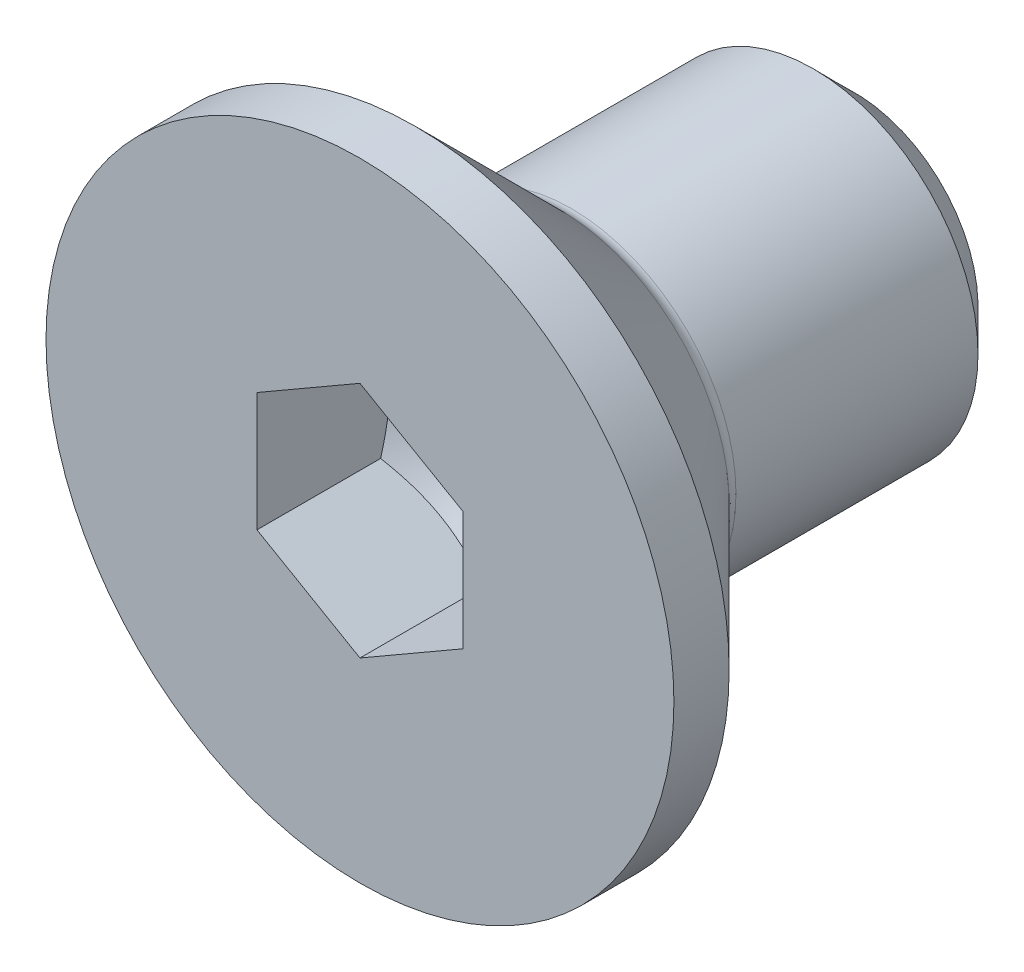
ISO-10303-21;
HEADER;
FILE_DESCRIPTION(('STEP AP214'),'2;1');
FILE_NAME('part.step','',(''),(''),'','','');
FILE_SCHEMA(('AUTOMOTIVE_DESIGN { 1 0 10303 214 1 1 1 1 }'));
ENDSEC;
DATA;
#1=APPLICATION_CONTEXT('core data for automotive mechanical design processes');
#2=APPLICATION_PROTOCOL_DEFINITION('international standard','automotive_design',2000,#1);
#3=PRODUCT_CONTEXT('',#1,'mechanical');
#4=PRODUCT('Part','Part','',(#3));
#5=PRODUCT_RELATED_PRODUCT_CATEGORY('part','',(#4));
#6=PRODUCT_DEFINITION_FORMATION('','',#4);
#7=PRODUCT_DEFINITION_CONTEXT('part definition',#1,'design');
#8=PRODUCT_DEFINITION('design','',#6,#7);
#9=PRODUCT_DEFINITION_SHAPE('','',#8);
#10=(LENGTH_UNIT() NAMED_UNIT(*) SI_UNIT(.MILLI.,.METRE.));
#11=(NAMED_UNIT(*) PLANE_ANGLE_UNIT() SI_UNIT($,.RADIAN.));
#12=(NAMED_UNIT(*) SI_UNIT($,.STERADIAN.) SOLID_ANGLE_UNIT());
#13=UNCERTAINTY_MEASURE_WITH_UNIT(LENGTH_MEASURE(1.E-05),#10,'distance_accuracy_value','');
#14=(GEOMETRIC_REPRESENTATION_CONTEXT(3) GLOBAL_UNCERTAINTY_ASSIGNED_CONTEXT((#13)) GLOBAL_UNIT_ASSIGNED_CONTEXT((#10,
#11,#12)) REPRESENTATION_CONTEXT('',''));
#15=CARTESIAN_POINT('',(0.,0.,0.));
#16=DIRECTION('',(0.,0.,1.));
#17=DIRECTION('',(1.,0.,0.));
#18=AXIS2_PLACEMENT_3D('',#15,#16,#17);
#19=CARTESIAN_POINT('',(2.5,1.44337567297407,-3.));
#20=DIRECTION('',(0.5,0.866025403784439,0.));
#21=DIRECTION('',(-0.866025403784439,0.5,0.));
#22=AXIS2_PLACEMENT_3D('',#19,#20,#21);
#23=PLANE('',#22);
#24=CARTESIAN_POINT('',(2.5002,1.44326020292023,-3.00137592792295));
#25=CARTESIAN_POINT('',(2.39033676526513,1.50668977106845,-3.03801197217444));
#26=CARTESIAN_POINT('',(2.27952520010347,1.57066685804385,-3.07133137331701));
#27=CARTESIAN_POINT('',(2.05598316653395,1.69972891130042,-3.12949130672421));
#28=CARTESIAN_POINT('',(1.94324872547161,1.7648161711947,-3.15431126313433));
#29=CARTESIAN_POINT('',(1.71917700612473,1.8941840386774,-3.19294794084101));
#30=CARTESIAN_POINT('',(1.60787420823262,1.95844473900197,-3.20702179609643));
#31=CARTESIAN_POINT('',(1.38474477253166,2.08726857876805,-3.22382443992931));
#32=CARTESIAN_POINT('',(1.27291894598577,2.15183124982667,-3.22656714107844));
#33=CARTESIAN_POINT('',(1.06395802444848,2.27247489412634,-3.22086783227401));
#34=CARTESIAN_POINT('',(0.966791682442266,2.3285739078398,-3.2138251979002));
#35=CARTESIAN_POINT('',(0.773092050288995,2.44040644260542,-3.19150217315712));
#36=CARTESIAN_POINT('',(0.676559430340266,2.4961395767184,-3.1762141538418));
#37=CARTESIAN_POINT('',(0.482460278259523,2.60820277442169,-3.13799449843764));
#38=CARTESIAN_POINT('',(0.384918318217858,2.66451865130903,-3.11490081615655));
#39=CARTESIAN_POINT('',(0.191289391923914,2.77631036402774,-3.06248693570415));
#40=CARTESIAN_POINT('',(0.0951999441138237,2.83178763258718,-3.03317905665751));
#41=CARTESIAN_POINT('',(-0.000199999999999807,2.88686681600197,-3.00137592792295));
#42=B_SPLINE_CURVE_WITH_KNOTS('',3,(#24,#25,#26,#27,#28,#29,#30,#31,#32,#33,#34,#35,#36,#37,#38,
#39,#40,#41),.UNSPECIFIED.,.F.,.F.,(4,2,2,2,2,2,2,2,4),(0.,0.396285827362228,0.793524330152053,
1.18093086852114,1.56786160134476,1.90479741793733,2.24204551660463,2.58677531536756,
2.93082800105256),.UNSPECIFIED.);
#43=CARTESIAN_POINT('',(2.5,1.44337567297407,-3.00144259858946));
#44=VERTEX_POINT('',#43);
#45=CARTESIAN_POINT('',(0.,2.88675134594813,-3.00144259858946));
#46=VERTEX_POINT('',#45);
#47=EDGE_CURVE('E91',#44,#46,#42,.T.);
#48=ORIENTED_EDGE('',*,*,#47,.F.);
#49=DIRECTION('',(0.,0.,1.));
#50=VECTOR('',#49,1.);
#51=CARTESIAN_POINT('',(2.5,1.44337567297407,-3.));
#52=LINE('',#51,#50);
#53=CARTESIAN_POINT('',(2.5,1.44337567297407,0.));
#54=VERTEX_POINT('',#53);
#55=EDGE_CURVE('E251',#44,#54,#52,.T.);
#56=ORIENTED_EDGE('',*,*,#55,.T.);
#57=DIRECTION('',(-0.866025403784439,0.5,0.));
#58=VECTOR('',#57,1.);
#59=CARTESIAN_POINT('',(2.5,1.44337567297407,0.));
#60=LINE('',#59,#58);
#61=CARTESIAN_POINT('',(0.,2.88675134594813,0.));
#62=VERTEX_POINT('',#61);
#63=EDGE_CURVE('E142',#54,#62,#60,.T.);
#64=ORIENTED_EDGE('',*,*,#63,.T.);
#65=DIRECTION('',(0.,0.,1.));
#66=VECTOR('',#65,1.);
#67=CARTESIAN_POINT('',(0.,2.88675134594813,-3.));
#68=LINE('',#67,#66);
#69=EDGE_CURVE('E257',#46,#62,#68,.T.);
#70=ORIENTED_EDGE('',*,*,#69,.F.);
#71=EDGE_LOOP('',(#48,#56,#64,#70));
#72=FACE_BOUND('',#71,.T.);
#73=ADVANCED_FACE('F76',(#72),#23,.F.);
#74=CARTESIAN_POINT('',(2.5,-1.44337567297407,-3.));
#75=DIRECTION('',(1.,0.,0.));
#76=DIRECTION('',(0.,1.,0.));
#77=AXIS2_PLACEMENT_3D('',#74,#75,#76);
#78=PLANE('',#77);
#79=CARTESIAN_POINT('',(2.5,-3.73850011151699,-2.07154852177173));
#80=CARTESIAN_POINT('',(2.5,-3.63052632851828,-2.12335298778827));
#81=CARTESIAN_POINT('',(2.5,-3.52228955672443,-2.17461952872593));
#82=CARTESIAN_POINT('',(2.5,-3.30514985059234,-2.2757715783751));
#83=CARTESIAN_POINT('',(2.5,-3.19624680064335,-2.32565683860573));
#84=CARTESIAN_POINT('',(2.5,-2.97700992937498,-2.42401983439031));
#85=CARTESIAN_POINT('',(2.5,-2.86667143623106,-2.47248719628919));
#86=CARTESIAN_POINT('',(2.5,-2.6450686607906,-2.56724909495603));
#87=CARTESIAN_POINT('',(2.5,-2.53380442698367,-2.61354374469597));
#88=CARTESIAN_POINT('',(2.5,-2.30724030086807,-2.70456123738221));
#89=CARTESIAN_POINT('',(2.5,-2.19191098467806,-2.74921126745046));
#90=CARTESIAN_POINT('',(2.5,-1.9598573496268,-2.83479989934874));
#91=CARTESIAN_POINT('',(2.5,-1.84313287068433,-2.87573807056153));
#92=CARTESIAN_POINT('',(2.5,-1.60837272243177,-2.95273233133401));
#93=CARTESIAN_POINT('',(2.5,-1.49034079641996,-2.98879971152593));
#94=CARTESIAN_POINT('',(2.5,-1.25258511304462,-3.05481890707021));
#95=CARTESIAN_POINT('',(2.5,-1.13286178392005,-3.08477224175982));
#96=CARTESIAN_POINT('',(2.5,-0.891988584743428,-3.13696297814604));
#97=CARTESIAN_POINT('',(2.5,-0.770842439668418,-3.15921723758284));
#98=CARTESIAN_POINT('',(2.5,-0.527194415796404,-3.19455824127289));
#99=CARTESIAN_POINT('',(2.5,-0.404692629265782,-3.20764560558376));
#100=CARTESIAN_POINT('',(2.5,-0.160479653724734,-3.22343854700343));
#101=CARTESIAN_POINT('',(2.5,-0.0387765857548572,-3.2262666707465));
#102=CARTESIAN_POINT('',(2.5,0.204439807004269,-3.2216164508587));
#103=CARTESIAN_POINT('',(2.5,0.325953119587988,-3.21413746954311));
#104=CARTESIAN_POINT('',(2.5,0.536349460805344,-3.19276822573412));
#105=CARTESIAN_POINT('',(2.5,0.625465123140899,-3.18106287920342));
#106=CARTESIAN_POINT('',(2.5,0.802951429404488,-3.15291349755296));
#107=CARTESIAN_POINT('',(2.5,0.891321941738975,-3.13646864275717));
#108=CARTESIAN_POINT('',(2.5,1.15527009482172,-3.08089453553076));
#109=CARTESIAN_POINT('',(2.5,1.32954690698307,-3.03554142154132));
#110=CARTESIAN_POINT('',(2.5,1.59014338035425,-2.95805542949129));
#111=CARTESIAN_POINT('',(2.5,1.677836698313,-2.93028920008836));
#112=CARTESIAN_POINT('',(2.5,1.85231554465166,-2.87218840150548));
#113=CARTESIAN_POINT('',(2.5,1.93910160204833,-2.84185543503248));
#114=CARTESIAN_POINT('',(2.5,2.11187542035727,-2.77906073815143));
#115=CARTESIAN_POINT('',(2.5,2.19786332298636,-2.74659939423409));
#116=CARTESIAN_POINT('',(2.5,2.36916197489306,-2.67989962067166));
#117=CARTESIAN_POINT('',(2.5,2.45447260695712,-2.64566089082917));
#118=CARTESIAN_POINT('',(2.5,2.67226144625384,-2.55605792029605));
#119=CARTESIAN_POINT('',(2.5,2.80430354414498,-2.49963503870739));
#120=CARTESIAN_POINT('',(2.5,3.06719777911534,-2.38407379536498));
#121=CARTESIAN_POINT('',(2.5,3.19804982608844,-2.32493523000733));
#122=CARTESIAN_POINT('',(2.5,3.45881006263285,-2.20455941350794));
#123=CARTESIAN_POINT('',(2.5,3.58871808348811,-2.14332179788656));
#124=CARTESIAN_POINT('',(2.5,3.84775157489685,-2.01921071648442));
#125=CARTESIAN_POINT('',(2.5,3.97687702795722,-1.95633721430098));
#126=CARTESIAN_POINT('',(2.5,4.3636121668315,-1.76563971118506));
#127=CARTESIAN_POINT('',(2.5,4.6202688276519,-1.6358848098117));
#128=CARTESIAN_POINT('',(2.5,5.13182456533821,-1.37305611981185));
#129=CARTESIAN_POINT('',(2.5,5.38672386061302,-1.23998275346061));
#130=CARTESIAN_POINT('',(2.5,5.87129631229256,-0.984205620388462));
#131=CARTESIAN_POINT('',(2.5,6.10107900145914,-0.861709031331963));
#132=CARTESIAN_POINT('',(2.5,6.5599052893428,-0.615321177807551));
#133=CARTESIAN_POINT('',(2.5,6.7889488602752,-0.491429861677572));
#134=CARTESIAN_POINT('',(2.5,7.24588433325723,-0.242917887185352));
#135=CARTESIAN_POINT('',(2.5,7.47377768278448,-0.118299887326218));
#136=CARTESIAN_POINT('',(2.5,7.92910363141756,0.131747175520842));
#137=CARTESIAN_POINT('',(2.5,8.15653625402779,0.25717619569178));
#138=CARTESIAN_POINT('',(2.5,8.38380336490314,0.382902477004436));
#139=B_SPLINE_CURVE_WITH_KNOTS('',3,(#79,#80,#81,#82,#83,#84,#85,#86,#87,#88,#89,#90,#91,#92,
#93,#94,#95,#96,#97,#98,#99,#100,#101,#102,#103,#104,#105,#106,#107,#108,#109,#110,#111,#112,
#113,#114,#115,#116,#117,#118,#119,#120,#121,#122,#123,#124,#125,#126,#127,#128,#129,#130,#131,
#132,#133,#134,#135,#136,#137,#138),.UNSPECIFIED.,.F.,.F.,(4,2,2,2,2,2,2,2,2,2,2,2,2,2,2,2,2,2,
2,2,2,2,2,2,2,2,2,2,2,4),(0.,0.359279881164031,0.718623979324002,1.08014786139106,
1.4416529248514,1.81261612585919,2.18362230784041,2.55375315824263,2.9237919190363,
3.29301524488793,3.66221359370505,4.02698707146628,4.39178311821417,4.66129328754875,
4.93085009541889,5.47037688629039,5.74630981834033,6.02207170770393,6.29778365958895,
6.57354233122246,7.00427418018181,7.43503837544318,7.8658777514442,8.29672672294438,
9.15945745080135,10.0220789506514,10.8032571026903,11.5844642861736,12.3636833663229,
13.1428616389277),.UNSPECIFIED.);
#140=CARTESIAN_POINT('',(2.5,-1.44337567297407,-3.00144259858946));
#141=VERTEX_POINT('',#140);
#142=EDGE_CURVE('E98',#141,#44,#139,.T.);
#143=ORIENTED_EDGE('',*,*,#142,.F.);
#144=DIRECTION('',(0.,0.,1.));
#145=VECTOR('',#144,1.);
#146=CARTESIAN_POINT('',(2.5,-1.44337567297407,-3.));
#147=LINE('',#146,#145);
#148=CARTESIAN_POINT('',(2.5,-1.44337567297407,0.));
#149=VERTEX_POINT('',#148);
#150=EDGE_CURVE('E254',#141,#149,#147,.T.);
#151=ORIENTED_EDGE('',*,*,#150,.T.);
#152=DIRECTION('',(0.,1.,0.));
#153=VECTOR('',#152,1.);
#154=CARTESIAN_POINT('',(2.5,-1.44337567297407,0.));
#155=LINE('',#154,#153);
#156=EDGE_CURVE('E260',#149,#54,#155,.T.);
#157=ORIENTED_EDGE('',*,*,#156,.T.);
#158=ORIENTED_EDGE('',*,*,#55,.F.);
#159=EDGE_LOOP('',(#143,#151,#157,#158));
#160=FACE_BOUND('',#159,.T.);
#161=ADVANCED_FACE('F163',(#160),#78,.F.);
#162=CARTESIAN_POINT('',(0.,-2.88675134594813,-3.));
#163=DIRECTION('',(0.5,-0.866025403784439,0.));
#164=DIRECTION('',(0.866025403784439,0.5,0.));
#165=AXIS2_PLACEMENT_3D('',#162,#163,#164);
#166=PLANE('',#165);
#167=CARTESIAN_POINT('',(-0.000200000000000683,-2.88686681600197,-3.00137592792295));
#168=CARTESIAN_POINT('',(0.109663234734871,-2.82343724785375,-3.03801197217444));
#169=CARTESIAN_POINT('',(0.220474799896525,-2.75946016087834,-3.07133137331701));
#170=CARTESIAN_POINT('',(0.44401683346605,-2.63039810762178,-3.12949130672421));
#171=CARTESIAN_POINT('',(0.556751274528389,-2.5653108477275,-3.15431126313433));
#172=CARTESIAN_POINT('',(0.78082299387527,-2.43594298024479,-3.19294794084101));
#173=CARTESIAN_POINT('',(0.892125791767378,-2.37168227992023,-3.20702179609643));
#174=CARTESIAN_POINT('',(1.11525522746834,-2.24285844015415,-3.22382443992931));
#175=CARTESIAN_POINT('',(1.22708105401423,-2.17829576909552,-3.22656714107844));
#176=CARTESIAN_POINT('',(1.43604197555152,-2.05765212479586,-3.22086783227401));
#177=CARTESIAN_POINT('',(1.53320831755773,-2.0015531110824,-3.2138251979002));
#178=CARTESIAN_POINT('',(1.726907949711,-1.88972057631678,-3.19150217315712));
#179=CARTESIAN_POINT('',(1.82344056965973,-1.8339874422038,-3.1762141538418));
#180=CARTESIAN_POINT('',(2.01753972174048,-1.7219242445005,-3.13799449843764));
#181=CARTESIAN_POINT('',(2.11508168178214,-1.66560836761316,-3.11490081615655));
#182=CARTESIAN_POINT('',(2.30871060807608,-1.55381665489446,-3.06248693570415));
#183=CARTESIAN_POINT('',(2.40480005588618,-1.49833938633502,-3.03317905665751));
#184=CARTESIAN_POINT('',(2.5002,-1.44326020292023,-3.00137592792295));
#185=B_SPLINE_CURVE_WITH_KNOTS('',3,(#167,#168,#169,#170,#171,#172,#173,#174,#175,#176,#177,
#178,#179,#180,#181,#182,#183,#184),.UNSPECIFIED.,.F.,.F.,(4,2,2,2,2,2,2,2,4),(0.,
0.396285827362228,0.793524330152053,1.18093086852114,1.56786160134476,1.90479741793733,
2.24204551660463,2.58677531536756,2.93082800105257),.UNSPECIFIED.);
#186=CARTESIAN_POINT('',(0.,-2.88675134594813,-3.00144259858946));
#187=VERTEX_POINT('',#186);
#188=EDGE_CURVE('E140',#187,#141,#185,.T.);
#189=ORIENTED_EDGE('',*,*,#188,.F.);
#190=DIRECTION('',(0.,0.,1.));
#191=VECTOR('',#190,1.);
#192=CARTESIAN_POINT('',(0.,-2.88675134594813,-3.));
#193=LINE('',#192,#191);
#194=CARTESIAN_POINT('',(0.,-2.88675134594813,0.));
#195=VERTEX_POINT('',#194);
#196=EDGE_CURVE('E264',#187,#195,#193,.T.);
#197=ORIENTED_EDGE('',*,*,#196,.T.);
#198=DIRECTION('',(0.866025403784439,0.5,0.));
#199=VECTOR('',#198,1.);
#200=CARTESIAN_POINT('',(0.,-2.88675134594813,0.));
#201=LINE('',#200,#199);
#202=EDGE_CURVE('E269',#195,#149,#201,.T.);
#203=ORIENTED_EDGE('',*,*,#202,.T.);
#204=ORIENTED_EDGE('',*,*,#150,.F.);
#205=EDGE_LOOP('',(#189,#197,#203,#204));
#206=FACE_BOUND('',#205,.T.);
#207=ADVANCED_FACE('F196',(#206),#166,.F.);
#208=CARTESIAN_POINT('',(-2.5,-1.44337567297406,-3.));
#209=DIRECTION('',(-0.5,-0.866025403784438,0.));
#210=DIRECTION('',(0.866025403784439,-0.5,0.));
#211=AXIS2_PLACEMENT_3D('',#208,#209,#210);
#212=PLANE('',#211);
#213=CARTESIAN_POINT('',(-2.5002,-1.44326020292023,-3.00137592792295));
#214=CARTESIAN_POINT('',(-2.39033676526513,-1.50668977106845,-3.03801197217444));
#215=CARTESIAN_POINT('',(-2.27952520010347,-1.57066685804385,-3.07133137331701));
#216=CARTESIAN_POINT('',(-2.05598316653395,-1.69972891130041,-3.12949130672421));
#217=CARTESIAN_POINT('',(-1.94324872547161,-1.7648161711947,-3.15431126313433));
#218=CARTESIAN_POINT('',(-1.71917700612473,-1.8941840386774,-3.19294794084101));
#219=CARTESIAN_POINT('',(-1.60787420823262,-1.95844473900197,-3.20702179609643));
#220=CARTESIAN_POINT('',(-1.38474477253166,-2.08726857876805,-3.22382443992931));
#221=CARTESIAN_POINT('',(-1.27291894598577,-2.15183124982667,-3.22656714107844));
#222=CARTESIAN_POINT('',(-1.06395802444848,-2.27247489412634,-3.22086783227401));
#223=CARTESIAN_POINT('',(-0.966791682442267,-2.32857390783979,-3.2138251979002));
#224=CARTESIAN_POINT('',(-0.773092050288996,-2.44040644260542,-3.19150217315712));
#225=CARTESIAN_POINT('',(-0.676559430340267,-2.4961395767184,-3.1762141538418));
#226=CARTESIAN_POINT('',(-0.482460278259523,-2.60820277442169,-3.13799449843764));
#227=CARTESIAN_POINT('',(-0.384918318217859,-2.66451865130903,-3.11490081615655));
#228=CARTESIAN_POINT('',(-0.191289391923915,-2.77631036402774,-3.06248693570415));
#229=CARTESIAN_POINT('',(-0.0951999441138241,-2.83178763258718,-3.03317905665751));
#230=CARTESIAN_POINT('',(0.000199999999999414,-2.88686681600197,-3.00137592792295));
#231=B_SPLINE_CURVE_WITH_KNOTS('',3,(#213,#214,#215,#216,#217,#218,#219,#220,#221,#222,#223,
#224,#225,#226,#227,#228,#229,#230),.UNSPECIFIED.,.F.,.F.,(4,2,2,2,2,2,2,2,4),(0.,
0.396285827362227,0.793524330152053,1.18093086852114,1.56786160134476,1.90479741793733,
2.24204551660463,2.58677531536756,2.93082800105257),.UNSPECIFIED.);
#232=CARTESIAN_POINT('',(-2.5,-1.44337567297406,-3.00144259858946));
#233=VERTEX_POINT('',#232);
#234=EDGE_CURVE('E144',#233,#187,#231,.T.);
#235=ORIENTED_EDGE('',*,*,#234,.F.);
#236=DIRECTION('',(0.,0.,1.));
#237=VECTOR('',#236,1.);
#238=CARTESIAN_POINT('',(-2.5,-1.44337567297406,-3.));
#239=LINE('',#238,#237);
#240=CARTESIAN_POINT('',(-2.5,-1.44337567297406,0.));
#241=VERTEX_POINT('',#240);
#242=EDGE_CURVE('E262',#233,#241,#239,.T.);
#243=ORIENTED_EDGE('',*,*,#242,.T.);
#244=DIRECTION('',(0.866025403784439,-0.5,0.));
#245=VECTOR('',#244,1.);
#246=CARTESIAN_POINT('',(-2.5,-1.44337567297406,0.));
#247=LINE('',#246,#245);
#248=EDGE_CURVE('E272',#241,#195,#247,.T.);
#249=ORIENTED_EDGE('',*,*,#248,.T.);
#250=ORIENTED_EDGE('',*,*,#196,.F.);
#251=EDGE_LOOP('',(#235,#243,#249,#250));
#252=FACE_BOUND('',#251,.T.);
#253=ADVANCED_FACE('F192',(#252),#212,.F.);
#254=CARTESIAN_POINT('',(-2.5,1.44337567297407,-3.));
#255=DIRECTION('',(-1.,0.,0.));
#256=DIRECTION('',(0.,0.,1.));
#257=AXIS2_PLACEMENT_3D('',#254,#255,#256);
#258=PLANE('',#257);
#259=CARTESIAN_POINT('',(-2.5,-3.73850011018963,-2.07154852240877));
#260=CARTESIAN_POINT('',(-2.5,-3.63052632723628,-2.12335298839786));
#261=CARTESIAN_POINT('',(-2.5,-3.52228955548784,-2.1746195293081));
#262=CARTESIAN_POINT('',(-2.5,-3.3051498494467,-2.27577157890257));
#263=CARTESIAN_POINT('',(-2.5,-3.19624679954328,-2.32565683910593));
#264=CARTESIAN_POINT('',(-2.5,-2.9770099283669,-2.42401983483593));
#265=CARTESIAN_POINT('',(-2.5,-2.86667143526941,-2.47248719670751));
#266=CARTESIAN_POINT('',(-2.5,-2.64506865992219,-2.56724909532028));
#267=CARTESIAN_POINT('',(-2.5,-2.53380442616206,-2.61354374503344));
#268=CARTESIAN_POINT('',(-2.5,-2.30724030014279,-2.70456123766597));
#269=CARTESIAN_POINT('',(-2.5,-2.19191098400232,-2.74921126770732));
#270=CARTESIAN_POINT('',(-2.5,-1.95985734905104,-2.83479989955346));
#271=CARTESIAN_POINT('',(-2.5,-1.843132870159,-2.875738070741));
#272=CARTESIAN_POINT('',(-2.5,-1.60837272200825,-2.95273233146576));
#273=CARTESIAN_POINT('',(-2.5,-1.49034079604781,-2.98879971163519));
#274=CARTESIAN_POINT('',(-2.5,-1.25258511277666,-3.0548189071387));
#275=CARTESIAN_POINT('',(-2.5,-1.13286178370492,-3.08477224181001));
#276=CARTESIAN_POINT('',(-2.5,-0.891988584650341,-3.13696297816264));
#277=CARTESIAN_POINT('',(-2.5,-0.770842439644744,-3.15921723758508));
#278=CARTESIAN_POINT('',(-2.5,-0.52719441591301,-3.19455824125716));
#279=CARTESIAN_POINT('',(-2.5,-0.404692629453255,-3.20764560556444));
#280=CARTESIAN_POINT('',(-2.5,-0.160479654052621,-3.22343854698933));
#281=CARTESIAN_POINT('',(-2.5,-0.0387765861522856,-3.22626667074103));
#282=CARTESIAN_POINT('',(-2.5,0.204439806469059,-3.221616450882));
#283=CARTESIAN_POINT('',(-2.5,0.325953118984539,-3.21413746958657));
#284=CARTESIAN_POINT('',(-2.5,0.536349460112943,-3.19276822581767));
#285=CARTESIAN_POINT('',(-2.5,0.625465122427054,-3.18106287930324));
#286=CARTESIAN_POINT('',(-2.5,0.802951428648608,-3.15291349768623));
#287=CARTESIAN_POINT('',(-2.5,0.891321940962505,-3.13646864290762));
#288=CARTESIAN_POINT('',(-2.5,1.15527009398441,-3.0808945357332));
#289=CARTESIAN_POINT('',(-2.5,1.32954690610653,-3.03554142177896));
#290=CARTESIAN_POINT('',(-2.5,1.59014337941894,-2.95805542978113));
#291=CARTESIAN_POINT('',(-2.5,1.67783669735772,-2.93028920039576));
#292=CARTESIAN_POINT('',(-2.5,1.85231554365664,-2.87218840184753));
#293=CARTESIAN_POINT('',(-2.5,1.93910160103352,-2.84185543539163));
#294=CARTESIAN_POINT('',(-2.5,2.11187541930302,-2.77906073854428));
#295=CARTESIAN_POINT('',(-2.5,2.19786332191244,-2.74659939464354));
#296=CARTESIAN_POINT('',(-2.5,2.36916197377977,-2.67989962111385));
#297=CARTESIAN_POINT('',(-2.5,2.45447260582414,-2.6456608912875));
#298=CARTESIAN_POINT('',(-2.5,2.67226144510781,-2.55605792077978));
#299=CARTESIAN_POINT('',(-2.5,2.80430354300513,-2.49963503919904));
#300=CARTESIAN_POINT('',(-2.5,3.06719777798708,-2.3840737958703));
#301=CARTESIAN_POINT('',(-2.5,3.19804982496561,-2.32493523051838));
#302=CARTESIAN_POINT('',(-2.5,3.45881006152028,-2.20455941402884));
#303=CARTESIAN_POINT('',(-2.5,3.58871808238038,-2.14332179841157));
#304=CARTESIAN_POINT('',(-2.5,3.84775157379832,-2.01921071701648));
#305=CARTESIAN_POINT('',(-2.5,3.97687702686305,-1.95633721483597));
#306=CARTESIAN_POINT('',(-2.5,4.36361216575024,-1.7656397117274));
#307=CARTESIAN_POINT('',(-2.5,4.62026882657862,-1.63588481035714));
#308=CARTESIAN_POINT('',(-2.5,5.13182456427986,-1.37305612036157));
#309=CARTESIAN_POINT('',(-2.5,5.38672385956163,-1.2399827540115));
#310=CARTESIAN_POINT('',(-2.5,5.8712963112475,-0.984205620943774));
#311=CARTESIAN_POINT('',(-2.5,6.10107900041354,-0.861709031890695));
#312=CARTESIAN_POINT('',(-2.5,6.55990528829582,-0.615321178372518));
#313=CARTESIAN_POINT('',(-2.5,6.78894885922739,-0.491429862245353));
#314=CARTESIAN_POINT('',(-2.5,7.24588433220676,-0.242917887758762));
#315=CARTESIAN_POINT('',(-2.5,7.47377768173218,-0.118299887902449));
#316=CARTESIAN_POINT('',(-2.5,7.92910363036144,0.131747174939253));
#317=CARTESIAN_POINT('',(-2.5,8.15653625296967,0.257176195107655));
#318=CARTESIAN_POINT('',(-2.5,8.38380336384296,0.382902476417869));
#319=B_SPLINE_CURVE_WITH_KNOTS('',3,(#259,#260,#261,#262,#263,#264,#265,#266,#267,#268,#269,
#270,#271,#272,#273,#274,#275,#276,#277,#278,#279,#280,#281,#282,#283,#284,#285,#286,#287,#288,
#289,#290,#291,#292,#293,#294,#295,#296,#297,#298,#299,#300,#301,#302,#303,#304,#305,#306,#307,
#308,#309,#310,#311,#312,#313,#314,#315,#316,#317,#318),.UNSPECIFIED.,.F.,.F.,(4,2,2,2,2,2,2,2,
2,2,2,2,2,2,2,2,2,2,2,2,2,2,2,2,2,2,2,2,2,4),(0.,0.359279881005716,0.718623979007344,
1.08014786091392,1.44165292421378,1.81261612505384,2.18362230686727,2.5537531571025,
2.92379191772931,3.29301524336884,3.66221359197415,4.02698706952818,4.39178311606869,
4.66129328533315,4.93085009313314,5.47037688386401,5.74630981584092,6.02207170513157,
6.29778365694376,6.57354232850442,7.0042741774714,7.43503837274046,7.86587774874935,
8.29672672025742,9.15945744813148,10.0220789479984,10.803257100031,11.5844642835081,
12.3636833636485,13.1428616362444),.UNSPECIFIED.);
#320=CARTESIAN_POINT('',(-2.5,1.44337567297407,-3.00144259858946));
#321=VERTEX_POINT('',#320);
#322=EDGE_CURVE('E180',#321,#233,#319,.F.);
#323=ORIENTED_EDGE('',*,*,#322,.F.);
#324=DIRECTION('',(0.,0.,1.));
#325=VECTOR('',#324,1.);
#326=CARTESIAN_POINT('',(-2.5,1.44337567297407,-3.));
#327=LINE('',#326,#325);
#328=CARTESIAN_POINT('',(-2.5,1.44337567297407,0.));
#329=VERTEX_POINT('',#328);
#330=EDGE_CURVE('E259',#321,#329,#327,.T.);
#331=ORIENTED_EDGE('',*,*,#330,.T.);
#332=DIRECTION('',(0.,-1.,0.));
#333=VECTOR('',#332,1.);
#334=CARTESIAN_POINT('',(-2.5,1.44337567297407,0.));
#335=LINE('',#334,#333);
#336=EDGE_CURVE('E275',#329,#241,#335,.T.);
#337=ORIENTED_EDGE('',*,*,#336,.T.);
#338=ORIENTED_EDGE('',*,*,#242,.F.);
#339=EDGE_LOOP('',(#323,#331,#337,#338));
#340=FACE_BOUND('',#339,.T.);
#341=ADVANCED_FACE('F195',(#340),#258,.F.);
#342=CARTESIAN_POINT('',(0.,2.88675134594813,-3.));
#343=DIRECTION('',(-0.5,0.866025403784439,0.));
#344=DIRECTION('',(-0.866025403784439,-0.5,0.));
#345=AXIS2_PLACEMENT_3D('',#342,#343,#344);
#346=PLANE('',#345);
#347=CARTESIAN_POINT('',(0.000200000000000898,2.88686681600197,-3.00137592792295));
#348=CARTESIAN_POINT('',(-0.10966323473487,2.82343724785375,-3.03801197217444));
#349=CARTESIAN_POINT('',(-0.220474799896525,2.75946016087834,-3.07133137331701));
#350=CARTESIAN_POINT('',(-0.444016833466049,2.63039810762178,-3.1294913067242));
#351=CARTESIAN_POINT('',(-0.556751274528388,2.5653108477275,-3.15431126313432));
#352=CARTESIAN_POINT('',(-0.780822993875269,2.43594298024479,-3.19294794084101));
#353=CARTESIAN_POINT('',(-0.892125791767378,2.37168227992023,-3.20702179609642));
#354=CARTESIAN_POINT('',(-1.11525522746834,2.24285844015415,-3.22382443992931));
#355=CARTESIAN_POINT('',(-1.22708105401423,2.17829576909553,-3.22656714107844));
#356=CARTESIAN_POINT('',(-1.43604197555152,2.05765212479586,-3.22086783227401));
#357=CARTESIAN_POINT('',(-1.53320831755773,2.0015531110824,-3.2138251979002));
#358=CARTESIAN_POINT('',(-1.726907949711,1.88972057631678,-3.19150217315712));
#359=CARTESIAN_POINT('',(-1.82344056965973,1.8339874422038,-3.1762141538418));
#360=CARTESIAN_POINT('',(-2.01753972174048,1.7219242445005,-3.13799449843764));
#361=CARTESIAN_POINT('',(-2.11508168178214,1.66560836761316,-3.11490081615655));
#362=CARTESIAN_POINT('',(-2.30871060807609,1.55381665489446,-3.06248693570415));
#363=CARTESIAN_POINT('',(-2.40480005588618,1.49833938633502,-3.03317905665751));
#364=CARTESIAN_POINT('',(-2.5002,1.44326020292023,-3.00137592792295));
#365=B_SPLINE_CURVE_WITH_KNOTS('',3,(#347,#348,#349,#350,#351,#352,#353,#354,#355,#356,#357,
#358,#359,#360,#361,#362,#363,#364),.UNSPECIFIED.,.F.,.F.,(4,2,2,2,2,2,2,2,4),(0.,
0.396285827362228,0.793524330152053,1.18093086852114,1.56786160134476,1.90479741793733,
2.24204551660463,2.58677531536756,2.93082800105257),.UNSPECIFIED.);
#366=EDGE_CURVE('E169',#46,#321,#365,.T.);
#367=ORIENTED_EDGE('',*,*,#366,.F.);
#368=ORIENTED_EDGE('',*,*,#69,.T.);
#369=DIRECTION('',(-0.866025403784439,-0.5,0.));
#370=VECTOR('',#369,1.);
#371=CARTESIAN_POINT('',(0.,2.88675134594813,0.));
#372=LINE('',#371,#370);
#373=EDGE_CURVE('E278',#62,#329,#372,.T.);
#374=ORIENTED_EDGE('',*,*,#373,.T.);
#375=ORIENTED_EDGE('',*,*,#330,.F.);
#376=EDGE_LOOP('',(#367,#368,#374,#375));
#377=FACE_BOUND('',#376,.T.);
#378=ADVANCED_FACE('F201',(#377),#346,.F.);
#379=CARTESIAN_POINT('',(0.,0.,0.));
#380=DIRECTION('',(0.,0.,-1.));
#381=DIRECTION('',(0.,1.,0.));
#382=AXIS2_PLACEMENT_3D('',#379,#380,#381);
#383=PLANE('',#382);
#384=ORIENTED_EDGE('',*,*,#373,.F.);
#385=ORIENTED_EDGE('',*,*,#63,.F.);
#386=ORIENTED_EDGE('',*,*,#156,.F.);
#387=ORIENTED_EDGE('',*,*,#202,.F.);
#388=ORIENTED_EDGE('',*,*,#248,.F.);
#389=ORIENTED_EDGE('',*,*,#336,.F.);
#390=EDGE_LOOP('',(#384,#385,#386,#387,#388,#389));
#391=FACE_BOUND('',#390,.T.);
#392=CARTESIAN_POINT('',(0.,0.,0.));
#393=DIRECTION('',(0.,0.,1.));
#394=DIRECTION('',(0.,-1.,0.));
#395=AXIS2_PLACEMENT_3D('',#392,#393,#394);
#396=CIRCLE('',#395,7.62000000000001);
#397=CARTESIAN_POINT('',(0.,-7.62000000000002,0.));
#398=VERTEX_POINT('',#397);
#399=EDGE_CURVE('E242',#398,#398,#396,.T.);
#400=ORIENTED_EDGE('',*,*,#399,.T.);
#401=EDGE_LOOP('',(#400));
#402=FACE_BOUND('',#401,.T.);
#403=ADVANCED_FACE('F205',(#391,#402),#383,.F.);
#404=CARTESIAN_POINT('',(0.,0.,-12.));
#405=DIRECTION('',(0.,0.,1.));
#406=DIRECTION('',(0.,-1.,0.));
#407=AXIS2_PLACEMENT_3D('',#404,#405,#406);
#408=CYLINDRICAL_SURFACE('',#407,7.62000000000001);
#409=ORIENTED_EDGE('',*,*,#399,.F.);
#410=EDGE_LOOP('',(#409));
#411=FACE_BOUND('',#410,.T.);
#412=CARTESIAN_POINT('',(0.,0.,-1.34000000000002));
#413=DIRECTION('',(0.,0.,1.));
#414=DIRECTION('',(0.,-1.,0.));
#415=AXIS2_PLACEMENT_3D('',#412,#413,#414);
#416=CIRCLE('',#415,7.62000000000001);
#417=CARTESIAN_POINT('',(0.,-7.62000000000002,-1.34000000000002));
#418=VERTEX_POINT('',#417);
#419=EDGE_CURVE('E249',#418,#418,#416,.T.);
#420=ORIENTED_EDGE('',*,*,#419,.T.);
#421=EDGE_LOOP('',(#420));
#422=FACE_BOUND('',#421,.T.);
#423=ADVANCED_FACE('F220',(#411,#422),#408,.T.);
#424=CARTESIAN_POINT('',(0.,0.,-4.96));
#425=DIRECTION('',(0.,0.,1.));
#426=DIRECTION('',(0.,-1.,0.));
#427=AXIS2_PLACEMENT_3D('',#424,#425,#426);
#428=CONICAL_SURFACE('',#427,4.00000000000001,0.785398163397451);
#429=CARTESIAN_POINT('',(0.,0.,-4.84284271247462));
#430=DIRECTION('',(0.,0.,1.));
#431=DIRECTION('',(0.,-1.,0.));
#432=AXIS2_PLACEMENT_3D('',#429,#430,#431);
#433=CIRCLE('',#432,4.11715728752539);
#434=CARTESIAN_POINT('',(0.,-4.11715728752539,-4.84284271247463));
#435=VERTEX_POINT('',#434);
#436=EDGE_CURVE('E84',#435,#435,#433,.T.);
#437=ORIENTED_EDGE('',*,*,#436,.T.);
#438=EDGE_LOOP('',(#437));
#439=FACE_BOUND('',#438,.T.);
#440=ORIENTED_EDGE('',*,*,#419,.F.);
#441=EDGE_LOOP('',(#440));
#442=FACE_BOUND('',#441,.T.);
#443=ADVANCED_FACE('F216',(#439,#442),#428,.T.);
#444=CARTESIAN_POINT('',(0.,0.,-12.));
#445=DIRECTION('',(0.,0.,1.));
#446=DIRECTION('',(0.,-1.,0.));
#447=AXIS2_PLACEMENT_3D('',#444,#445,#446);
#448=CYLINDRICAL_SURFACE('',#447,4.00000000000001);
#449=CARTESIAN_POINT('',(0.,0.,-5.12568542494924));
#450=DIRECTION('',(0.,0.,1.));
#451=DIRECTION('',(0.,-1.,0.));
#452=AXIS2_PLACEMENT_3D('',#449,#450,#451);
#453=CIRCLE('',#452,4.00000000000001);
#454=CARTESIAN_POINT('',(0.,-4.00000000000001,-5.12568542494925));
#455=VERTEX_POINT('',#454);
#456=EDGE_CURVE('E49',#455,#455,#453,.F.);
#457=ORIENTED_EDGE('',*,*,#456,.T.);
#458=EDGE_LOOP('',(#457));
#459=FACE_BOUND('',#458,.T.);
#460=CARTESIAN_POINT('',(0.,0.,-11.));
#461=DIRECTION('',(0.,0.,1.));
#462=DIRECTION('',(0.,-1.,0.));
#463=AXIS2_PLACEMENT_3D('',#460,#461,#462);
#464=CIRCLE('',#463,4.00000000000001);
#465=CARTESIAN_POINT('',(0.,-4.00000000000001,-11.));
#466=VERTEX_POINT('',#465);
#467=EDGE_CURVE('E239',#466,#466,#464,.T.);
#468=ORIENTED_EDGE('',*,*,#467,.T.);
#469=EDGE_LOOP('',(#468));
#470=FACE_BOUND('',#469,.T.);
#471=ADVANCED_FACE('F212',(#459,#470),#448,.T.);
#472=CARTESIAN_POINT('',(0.,4.,-12.));
#473=DIRECTION('',(0.,0.,1.));
#474=DIRECTION('',(0.,-1.,0.));
#475=AXIS2_PLACEMENT_3D('',#472,#473,#474);
#476=PLANE('',#475);
#477=CARTESIAN_POINT('',(0.,0.,-12.));
#478=DIRECTION('',(0.,0.,1.));
#479=DIRECTION('',(0.,-1.,0.));
#480=AXIS2_PLACEMENT_3D('',#477,#478,#479);
#481=CIRCLE('',#480,3.00000000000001);
#482=CARTESIAN_POINT('',(0.,-3.00000000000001,-12.));
#483=VERTEX_POINT('',#482);
#484=EDGE_CURVE('E236',#483,#483,#481,.F.);
#485=ORIENTED_EDGE('',*,*,#484,.T.);
#486=EDGE_LOOP('',(#485));
#487=FACE_BOUND('',#486,.T.);
#488=ADVANCED_FACE('F135',(#487),#476,.F.);
#489=CARTESIAN_POINT('',(0.,0.,-3.));
#490=DIRECTION('',(0.,0.,1.));
#491=DIRECTION('',(1.,0.,0.));
#492=AXIS2_PLACEMENT_3D('',#489,#490,#491);
#493=CONICAL_SURFACE('',#492,2.88925,1.04719755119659);
#494=CARTESIAN_POINT('',(0.,0.,-4.66810926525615));
#495=VERTEX_POINT('',#494);
#496=VERTEX_LOOP('',#495);
#497=FACE_BOUND('',#496,.T.);
#498=ORIENTED_EDGE('',*,*,#142,.T.);
#499=ORIENTED_EDGE('',*,*,#47,.T.);
#500=ORIENTED_EDGE('',*,*,#366,.T.);
#501=ORIENTED_EDGE('',*,*,#322,.T.);
#502=ORIENTED_EDGE('',*,*,#234,.T.);
#503=ORIENTED_EDGE('',*,*,#188,.T.);
#504=EDGE_LOOP('',(#498,#499,#500,#501,#502,#503));
#505=FACE_BOUND('',#504,.T.);
#506=ADVANCED_FACE('F131',(#497,#505),#493,.F.);
#507=CARTESIAN_POINT('',(0.,0.,-11.));
#508=DIRECTION('',(0.,0.,1.));
#509=DIRECTION('',(0.,-1.,0.));
#510=AXIS2_PLACEMENT_3D('',#507,#508,#509);
#511=CONICAL_SURFACE('',#510,4.00000000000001,0.785398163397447);
#512=ORIENTED_EDGE('',*,*,#484,.F.);
#513=EDGE_LOOP('',(#512));
#514=FACE_BOUND('',#513,.T.);
#515=ORIENTED_EDGE('',*,*,#467,.F.);
#516=EDGE_LOOP('',(#515));
#517=FACE_BOUND('',#516,.T.);
#518=ADVANCED_FACE('F134',(#514,#517),#511,.T.);
#519=CARTESIAN_POINT('',(0.,0.,-5.12568542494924));
#520=DIRECTION('',(0.,0.,1.));
#521=DIRECTION('',(0.,-1.,0.));
#522=AXIS2_PLACEMENT_3D('',#519,#520,#521);
#523=TOROIDAL_SURFACE('',#522,4.40000000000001,0.4);
#524=ORIENTED_EDGE('',*,*,#456,.F.);
#525=EDGE_LOOP('',(#524));
#526=FACE_BOUND('',#525,.T.);
#527=ORIENTED_EDGE('',*,*,#436,.F.);
#528=EDGE_LOOP('',(#527));
#529=FACE_BOUND('',#528,.T.);
#530=ADVANCED_FACE('F78',(#526,#529),#523,.F.);
#531=CLOSED_SHELL('',(#73,#161,#207,#253,#341,#378,#403,#423,#443,#471,#488,#506,#518,#530));
#532=MANIFOLD_SOLID_BREP('B6',#531);
#533=ADVANCED_BREP_SHAPE_REPRESENTATION('',(#18,#532),#14);
#534=SHAPE_DEFINITION_REPRESENTATION(#9,#533);
ENDSEC;
END-ISO-10303-21;
